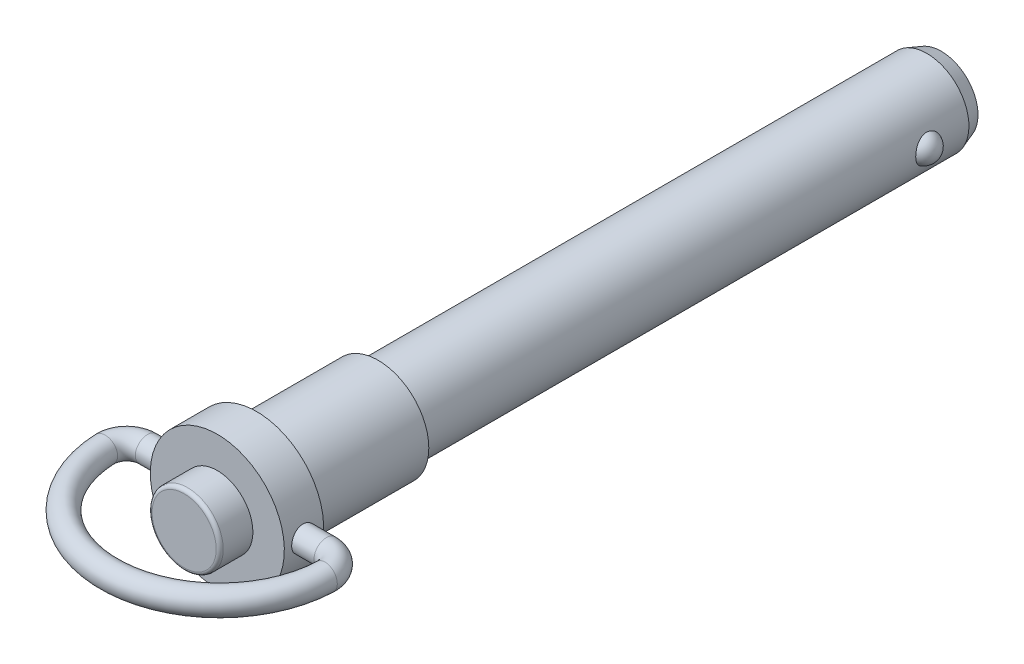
ISO-10303-21;
HEADER;
FILE_DESCRIPTION(('STEP AP214'),'2;1');
FILE_NAME('part.step','',(''),(''),'','','');
FILE_SCHEMA(('AUTOMOTIVE_DESIGN { 1 0 10303 214 1 1 1 1 }'));
ENDSEC;
DATA;
#1=APPLICATION_CONTEXT('core data for automotive mechanical design processes');
#2=APPLICATION_PROTOCOL_DEFINITION('international standard','automotive_design',2000,#1);
#3=PRODUCT_CONTEXT('',#1,'mechanical');
#4=PRODUCT('Part','Part','',(#3));
#5=PRODUCT_RELATED_PRODUCT_CATEGORY('part','',(#4));
#6=PRODUCT_DEFINITION_FORMATION('','',#4);
#7=PRODUCT_DEFINITION_CONTEXT('part definition',#1,'design');
#8=PRODUCT_DEFINITION('design','',#6,#7);
#9=PRODUCT_DEFINITION_SHAPE('','',#8);
#10=(LENGTH_UNIT() NAMED_UNIT(*) SI_UNIT(.MILLI.,.METRE.));
#11=(NAMED_UNIT(*) PLANE_ANGLE_UNIT() SI_UNIT($,.RADIAN.));
#12=(NAMED_UNIT(*) SI_UNIT($,.STERADIAN.) SOLID_ANGLE_UNIT());
#13=UNCERTAINTY_MEASURE_WITH_UNIT(LENGTH_MEASURE(1.E-05),#10,'distance_accuracy_value','');
#14=(GEOMETRIC_REPRESENTATION_CONTEXT(3) GLOBAL_UNCERTAINTY_ASSIGNED_CONTEXT((#13)) GLOBAL_UNIT_ASSIGNED_CONTEXT((#10,
#11,#12)) REPRESENTATION_CONTEXT('',''));
#15=CARTESIAN_POINT('',(0.,0.,0.));
#16=DIRECTION('',(0.,0.,1.));
#17=DIRECTION('',(1.,0.,0.));
#18=AXIS2_PLACEMENT_3D('',#15,#16,#17);
#19=CARTESIAN_POINT('',(0.,0.,27.575));
#20=DIRECTION('',(0.,0.,1.));
#21=DIRECTION('',(1.,0.,0.));
#22=AXIS2_PLACEMENT_3D('',#19,#20,#21);
#23=PLANE('',#22);
#24=CARTESIAN_POINT('',(0.,0.,27.575));
#25=DIRECTION('',(0.,0.,1.));
#26=DIRECTION('',(1.,0.,0.));
#27=AXIS2_PLACEMENT_3D('',#24,#25,#26);
#28=CIRCLE('',#27,4.5546);
#29=CARTESIAN_POINT('',(4.5546,0.,27.575));
#30=VERTEX_POINT('',#29);
#31=EDGE_CURVE('E144',#30,#30,#28,.T.);
#32=ORIENTED_EDGE('',*,*,#31,.T.);
#33=EDGE_LOOP('',(#32));
#34=FACE_BOUND('',#33,.T.);
#35=ADVANCED_FACE('F12',(#34),#23,.T.);
#36=CARTESIAN_POINT('',(0.,0.,22.5357550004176));
#37=DIRECTION('',(0.,1.,0.));
#38=DIRECTION('',(0.,0.,1.));
#39=AXIS2_PLACEMENT_3D('',#36,#37,#38);
#40=TOROIDAL_SURFACE('',#39,15.6980038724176,1.75);
#41=CARTESIAN_POINT('',(-15.6851704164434,0.,23.1703844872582));
#42=DIRECTION('',(-0.0404274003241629,0.,-0.999182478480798));
#43=DIRECTION('',(-0.999182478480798,0.,0.0404274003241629));
#44=AXIS2_PLACEMENT_3D('',#41,#42,#43);
#45=CIRCLE('',#44,1.75);
#46=CARTESIAN_POINT('',(-17.4337397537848,0.,23.2411324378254));
#47=VERTEX_POINT('',#46);
#48=EDGE_CURVE('E145',#47,#47,#45,.T.);
#49=CARTESIAN_POINT('',(15.6851704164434,0.,23.1703844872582));
#50=DIRECTION('',(-0.0404274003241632,0.,0.999182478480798));
#51=DIRECTION('',(0.999182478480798,0.,0.0404274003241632));
#52=AXIS2_PLACEMENT_3D('',#49,#50,#51);
#53=CIRCLE('',#52,1.75);
#54=CARTESIAN_POINT('',(17.4337397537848,0.,23.2411324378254));
#55=VERTEX_POINT('',#54);
#56=EDGE_CURVE('E137',#55,#55,#53,.T.);
#57=CARTESIAN_POINT('',(0.,0.,22.5357550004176));
#58=DIRECTION('',(0.,1.,0.));
#59=DIRECTION('',(0.,0.,1.));
#60=AXIS2_PLACEMENT_3D('',#57,#58,#59);
#61=CIRCLE('',#60,17.4480038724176);
#62=EDGE_CURVE('',#47,#55,#61,.T.);
#63=ORIENTED_EDGE('',*,*,#48,.F.);
#64=ORIENTED_EDGE('',*,*,#56,.T.);
#65=ORIENTED_EDGE('',*,*,#62,.T.);
#66=ORIENTED_EDGE('',*,*,#62,.F.);
#67=EDGE_LOOP('',(#63,#65,#64,#66));
#68=FACE_BOUND('',#67,.T.);
#69=ADVANCED_FACE('F74',(#68),#40,.T.);
#70=CARTESIAN_POINT('',(0.,0.,27.075));
#71=DIRECTION('',(0.,0.,1.));
#72=DIRECTION('',(1.,0.,0.));
#73=AXIS2_PLACEMENT_3D('',#70,#71,#72);
#74=TOROIDAL_SURFACE('',#73,4.5546,0.5);
#75=CARTESIAN_POINT('',(0.,0.,27.075));
#76=DIRECTION('',(0.,0.,1.));
#77=DIRECTION('',(1.,0.,0.));
#78=AXIS2_PLACEMENT_3D('',#75,#76,#77);
#79=CIRCLE('',#78,5.0546);
#80=CARTESIAN_POINT('',(5.0546,0.,27.075));
#81=VERTEX_POINT('',#80);
#82=EDGE_CURVE('E150',#81,#81,#79,.T.);
#83=ORIENTED_EDGE('',*,*,#82,.T.);
#84=EDGE_LOOP('',(#83));
#85=FACE_BOUND('',#84,.T.);
#86=ORIENTED_EDGE('',*,*,#31,.F.);
#87=EDGE_LOOP('',(#86));
#88=FACE_BOUND('',#87,.T.);
#89=ADVANCED_FACE('F80',(#85,#88),#74,.T.);
#90=CARTESIAN_POINT('',(12.7038508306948,0.,23.0497588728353));
#91=DIRECTION('',(0.,1.,0.));
#92=DIRECTION('',(0.,0.,1.));
#93=AXIS2_PLACEMENT_3D('',#90,#91,#92);
#94=TOROIDAL_SURFACE('',#93,2.98375887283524,1.75);
#95=CARTESIAN_POINT('',(12.7038508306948,0.,20.066));
#96=DIRECTION('',(1.,0.,0.));
#97=DIRECTION('',(0.,0.,-1.));
#98=AXIS2_PLACEMENT_3D('',#95,#96,#97);
#99=CIRCLE('',#98,1.75);
#100=CARTESIAN_POINT('',(12.7038508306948,0.,18.316));
#101=VERTEX_POINT('',#100);
#102=EDGE_CURVE('E140',#101,#101,#99,.T.);
#103=CARTESIAN_POINT('',(12.7038508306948,0.,23.0497588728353));
#104=DIRECTION('',(0.,1.,0.));
#105=DIRECTION('',(0.,0.,1.));
#106=AXIS2_PLACEMENT_3D('',#103,#104,#105);
#107=CIRCLE('',#106,4.73375887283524);
#108=EDGE_CURVE('',#55,#101,#107,.T.);
#109=ORIENTED_EDGE('',*,*,#56,.F.);
#110=ORIENTED_EDGE('',*,*,#102,.T.);
#111=ORIENTED_EDGE('',*,*,#108,.T.);
#112=ORIENTED_EDGE('',*,*,#108,.F.);
#113=EDGE_LOOP('',(#109,#111,#110,#112));
#114=FACE_BOUND('',#113,.T.);
#115=ADVANCED_FACE('F90',(#114),#94,.T.);
#116=CARTESIAN_POINT('',(-12.7038508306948,0.,23.0497588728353));
#117=DIRECTION('',(0.,1.,0.));
#118=DIRECTION('',(0.,0.,1.));
#119=AXIS2_PLACEMENT_3D('',#116,#117,#118);
#120=TOROIDAL_SURFACE('',#119,2.98375887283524,1.75);
#121=CARTESIAN_POINT('',(-12.7038508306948,0.,20.066));
#122=DIRECTION('',(1.,0.,0.));
#123=DIRECTION('',(0.,0.,-1.));
#124=AXIS2_PLACEMENT_3D('',#121,#122,#123);
#125=CIRCLE('',#124,1.75);
#126=CARTESIAN_POINT('',(-12.7038508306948,0.,18.316));
#127=VERTEX_POINT('',#126);
#128=EDGE_CURVE('E307',#127,#127,#125,.T.);
#129=CARTESIAN_POINT('',(-12.7038508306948,0.,23.0497588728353));
#130=DIRECTION('',(0.,1.,0.));
#131=DIRECTION('',(0.,0.,1.));
#132=AXIS2_PLACEMENT_3D('',#129,#130,#131);
#133=CIRCLE('',#132,4.73375887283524);
#134=EDGE_CURVE('',#127,#47,#133,.T.);
#135=ORIENTED_EDGE('',*,*,#128,.F.);
#136=ORIENTED_EDGE('',*,*,#48,.T.);
#137=ORIENTED_EDGE('',*,*,#134,.T.);
#138=ORIENTED_EDGE('',*,*,#134,.F.);
#139=EDGE_LOOP('',(#135,#137,#136,#138));
#140=FACE_BOUND('',#139,.T.);
#141=ADVANCED_FACE('F105',(#140),#120,.T.);
#142=CARTESIAN_POINT('',(0.,0.,28.575));
#143=DIRECTION('',(0.,0.,-1.));
#144=DIRECTION('',(0.,-1.,0.));
#145=AXIS2_PLACEMENT_3D('',#142,#143,#144);
#146=CYLINDRICAL_SURFACE('',#145,5.0546);
#147=ORIENTED_EDGE('',*,*,#82,.F.);
#148=EDGE_LOOP('',(#147));
#149=FACE_BOUND('',#148,.T.);
#150=CARTESIAN_POINT('',(0.,0.,22.86));
#151=DIRECTION('',(0.,0.,-1.));
#152=DIRECTION('',(0.,-1.,0.));
#153=AXIS2_PLACEMENT_3D('',#150,#151,#152);
#154=CIRCLE('',#153,5.0546);
#155=CARTESIAN_POINT('',(0.,-5.0546,22.86));
#156=VERTEX_POINT('',#155);
#157=EDGE_CURVE('E122',#156,#156,#154,.T.);
#158=ORIENTED_EDGE('',*,*,#157,.F.);
#159=EDGE_LOOP('',(#158));
#160=FACE_BOUND('',#159,.T.);
#161=ADVANCED_FACE('F102',(#149,#160),#146,.T.);
#162=CARTESIAN_POINT('',(12.7038508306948,0.,20.066));
#163=DIRECTION('',(-1.,0.,0.));
#164=DIRECTION('',(0.,0.,1.));
#165=AXIS2_PLACEMENT_3D('',#162,#163,#164);
#166=CYLINDRICAL_SURFACE('',#165,1.75);
#167=CARTESIAN_POINT('',(9.525,0.,21.816));
#168=CARTESIAN_POINT('',(9.52499824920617,0.0974196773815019,21.8159962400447));
#169=CARTESIAN_POINT('',(9.52348996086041,0.194888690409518,21.8078377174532));
#170=CARTESIAN_POINT('',(9.51761845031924,0.387082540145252,21.7754387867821));
#171=CARTESIAN_POINT('',(9.5132527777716,0.481804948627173,21.7511845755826));
#172=CARTESIAN_POINT('',(9.50215510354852,0.66569803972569,21.6873599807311));
#173=CARTESIAN_POINT('',(9.49542520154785,0.75487356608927,21.6478031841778));
#174=CARTESIAN_POINT('',(9.48033492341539,0.925313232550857,21.5545343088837));
#175=CARTESIAN_POINT('',(9.4719746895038,1.00657806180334,21.5008234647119));
#176=CARTESIAN_POINT('',(9.45443959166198,1.15983447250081,21.38011409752));
#177=CARTESIAN_POINT('',(9.44525721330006,1.23172173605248,21.3129842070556));
#178=CARTESIAN_POINT('',(9.42716883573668,1.36328019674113,21.1676249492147));
#179=CARTESIAN_POINT('',(9.41826285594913,1.42295053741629,21.0893948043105));
#180=CARTESIAN_POINT('',(9.40166266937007,1.52881224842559,20.9233223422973));
#181=CARTESIAN_POINT('',(9.39397815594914,1.57489805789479,20.8354116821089));
#182=CARTESIAN_POINT('',(9.3807965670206,1.65160688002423,20.6529311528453));
#183=CARTESIAN_POINT('',(9.3752993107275,1.68223117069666,20.5583618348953));
#184=CARTESIAN_POINT('',(9.36719014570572,1.72681399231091,20.3663627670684));
#185=CARTESIAN_POINT('',(9.36454682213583,1.74095411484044,20.2689765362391));
#186=CARTESIAN_POINT('',(9.36235004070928,1.75273074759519,20.0731807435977));
#187=CARTESIAN_POINT('',(9.3627963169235,1.75036867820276,19.9747712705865));
#188=CARTESIAN_POINT('',(9.36669969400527,1.72935535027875,19.7810343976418));
#189=CARTESIAN_POINT('',(9.37011871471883,1.71091010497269,19.6856837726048));
#190=CARTESIAN_POINT('',(9.37952256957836,1.65857824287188,19.49945389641));
#191=CARTESIAN_POINT('',(9.38550750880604,1.62469099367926,19.4085748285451));
#192=CARTESIAN_POINT('',(9.39940890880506,1.54223419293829,19.2332623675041));
#193=CARTESIAN_POINT('',(9.40733632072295,1.49358101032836,19.1488692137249));
#194=CARTESIAN_POINT('',(9.42422213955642,1.38303261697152,18.98936699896));
#195=CARTESIAN_POINT('',(9.43318064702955,1.32113611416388,18.9142588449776));
#196=CARTESIAN_POINT('',(9.45128545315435,1.184745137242,18.77426795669));
#197=CARTESIAN_POINT('',(9.46043254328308,1.11007434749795,18.7095569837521));
#198=CARTESIAN_POINT('',(9.47775926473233,0.950845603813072,18.5935547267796));
#199=CARTESIAN_POINT('',(9.48593888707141,0.866287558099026,18.5422635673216));
#200=CARTESIAN_POINT('',(9.50042458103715,0.689508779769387,18.4545334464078));
#201=CARTESIAN_POINT('',(9.50672846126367,0.597279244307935,18.4181118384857));
#202=CARTESIAN_POINT('',(9.51673535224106,0.407869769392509,18.3613256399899));
#203=CARTESIAN_POINT('',(9.52043862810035,0.310690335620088,18.3409594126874));
#204=CARTESIAN_POINT('',(9.5247907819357,0.115617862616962,18.3170999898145));
#205=CARTESIAN_POINT('',(9.52548227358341,0.0177545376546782,18.313371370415));
#206=CARTESIAN_POINT('',(9.52385046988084,-0.17719740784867,18.3222622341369));
#207=CARTESIAN_POINT('',(9.52152731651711,-0.274286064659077,18.3348809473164));
#208=CARTESIAN_POINT('',(9.51415375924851,-0.46418965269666,18.3759125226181));
#209=CARTESIAN_POINT('',(9.50912384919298,-0.557031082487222,18.4042067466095));
#210=CARTESIAN_POINT('',(9.49689842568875,-0.736652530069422,18.4756581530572));
#211=CARTESIAN_POINT('',(9.48970276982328,-0.823432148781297,18.5188163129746));
#212=CARTESIAN_POINT('',(9.47383776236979,-0.98947475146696,18.6192949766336));
#213=CARTESIAN_POINT('',(9.46515367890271,-1.06864888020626,18.676759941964));
#214=CARTESIAN_POINT('',(9.44731421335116,-1.21631462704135,18.8040249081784));
#215=CARTESIAN_POINT('',(9.43815878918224,-1.28480528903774,18.873826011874));
#216=CARTESIAN_POINT('',(9.42026781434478,-1.41005035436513,19.0248458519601));
#217=CARTESIAN_POINT('',(9.41153908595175,-1.46664438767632,19.1061985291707));
#218=CARTESIAN_POINT('',(9.39562517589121,-1.56536359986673,19.277394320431));
#219=CARTESIAN_POINT('',(9.38843993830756,-1.60748930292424,19.3672371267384));
#220=CARTESIAN_POINT('',(9.3764796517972,-1.67584630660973,19.5524479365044));
#221=CARTESIAN_POINT('',(9.37169329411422,-1.70215230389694,19.6477876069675));
#222=CARTESIAN_POINT('',(9.36504636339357,-1.73835449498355,19.8416293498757));
#223=CARTESIAN_POINT('',(9.36318547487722,-1.7482524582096,19.9401310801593));
#224=CARTESIAN_POINT('',(9.3626157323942,-1.75130025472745,20.1358954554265));
#225=CARTESIAN_POINT('',(9.36385929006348,-1.74470294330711,20.2331541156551));
#226=CARTESIAN_POINT('',(9.36925303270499,-1.71549975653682,20.4251511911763));
#227=CARTESIAN_POINT('',(9.37340320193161,-1.69289396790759,20.5198896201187));
#228=CARTESIAN_POINT('',(9.38412287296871,-1.63242039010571,20.7040281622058));
#229=CARTESIAN_POINT('',(9.39068820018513,-1.5945789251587,20.7934371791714));
#230=CARTESIAN_POINT('',(9.40550157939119,-1.50473547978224,20.964677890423));
#231=CARTESIAN_POINT('',(9.41374974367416,-1.45273255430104,21.0465090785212));
#232=CARTESIAN_POINT('',(9.43114776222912,-1.33515884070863,21.2015399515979));
#233=CARTESIAN_POINT('',(9.44030888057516,-1.26940363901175,21.2745985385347));
#234=CARTESIAN_POINT('',(9.45841527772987,-1.12657740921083,21.4087295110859));
#235=CARTESIAN_POINT('',(9.4673605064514,-1.04950378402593,21.4697991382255));
#236=CARTESIAN_POINT('',(9.4841172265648,-0.885436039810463,21.5787070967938));
#237=CARTESIAN_POINT('',(9.49191831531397,-0.798362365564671,21.6264272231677));
#238=CARTESIAN_POINT('',(9.50540634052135,-0.617319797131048,21.7064857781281));
#239=CARTESIAN_POINT('',(9.51109528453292,-0.523357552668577,21.7388388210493));
#240=CARTESIAN_POINT('',(9.51854259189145,-0.357584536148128,21.7805891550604));
#241=CARTESIAN_POINT('',(9.52095058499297,-0.286749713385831,21.7938458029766));
#242=CARTESIAN_POINT('',(9.52417991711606,-0.143952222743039,21.8115525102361));
#243=CARTESIAN_POINT('',(9.52500129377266,-0.0719895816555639,21.8160027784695));
#244=CARTESIAN_POINT('',(9.525,0.,21.816));
#245=B_SPLINE_CURVE_WITH_KNOTS('',3,(#167,#168,#169,#170,#171,#172,#173,#174,#175,#176,#177,
#178,#179,#180,#181,#182,#183,#184,#185,#186,#187,#188,#189,#190,#191,#192,#193,#194,#195,#196,
#197,#198,#199,#200,#201,#202,#203,#204,#205,#206,#207,#208,#209,#210,#211,#212,#213,#214,#215,
#216,#217,#218,#219,#220,#221,#222,#223,#224,#225,#226,#227,#228,#229,#230,#231,#232,#233,#234,
#235,#236,#237,#238,#239,#240,#241,#242,#243,#244),.UNSPECIFIED.,.T.,.F.,(4,2,2,2,2,2,2,2,2,2,2,
2,2,2,2,2,2,2,2,2,2,2,2,2,2,2,2,2,2,2,2,2,2,2,2,2,2,2,4),(0.,0.291995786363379,
0.584242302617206,0.876229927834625,1.16819209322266,1.46316632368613,1.75816122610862,
2.05539140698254,2.35259701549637,2.64649667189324,2.94037103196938,3.23053548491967,
3.52071182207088,3.81256333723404,4.10444333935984,4.40073615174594,4.69703171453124,
4.9936720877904,5.29028221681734,5.58268169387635,5.87506739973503,6.1652698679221,
6.45549142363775,6.74877158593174,7.04207797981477,7.3391152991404,7.63614185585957,
7.93175468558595,8.22733563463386,8.51841349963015,8.80948978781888,9.10006529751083,
9.39066020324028,9.68543533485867,9.98027821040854,10.2776546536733,10.574747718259,
10.7905270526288,11.0063012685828),.UNSPECIFIED.);
#246=CARTESIAN_POINT('',(9.525,0.,21.816));
#247=VERTEX_POINT('',#246);
#248=EDGE_CURVE('E29',#247,#247,#245,.T.);
#249=ORIENTED_EDGE('',*,*,#248,.F.);
#250=EDGE_LOOP('',(#249));
#251=FACE_BOUND('',#250,.T.);
#252=ORIENTED_EDGE('',*,*,#102,.F.);
#253=EDGE_LOOP('',(#252));
#254=FACE_BOUND('',#253,.T.);
#255=ADVANCED_FACE('F85',(#251,#254),#166,.T.);
#256=CARTESIAN_POINT('',(-12.7038508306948,0.,20.066));
#257=DIRECTION('',(1.,0.,0.));
#258=DIRECTION('',(0.,0.,-1.));
#259=AXIS2_PLACEMENT_3D('',#256,#257,#258);
#260=CYLINDRICAL_SURFACE('',#259,1.75);
#261=CARTESIAN_POINT('',(-9.525,0.,18.316));
#262=CARTESIAN_POINT('',(-9.52499824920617,-0.097419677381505,18.3160037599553));
#263=CARTESIAN_POINT('',(-9.52348996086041,-0.194888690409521,18.3241622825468));
#264=CARTESIAN_POINT('',(-9.51761845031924,-0.387082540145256,18.3565612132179));
#265=CARTESIAN_POINT('',(-9.5132527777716,-0.481804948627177,18.3808154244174));
#266=CARTESIAN_POINT('',(-9.50215510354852,-0.665698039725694,18.4446400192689));
#267=CARTESIAN_POINT('',(-9.49542520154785,-0.754873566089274,18.4841968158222));
#268=CARTESIAN_POINT('',(-9.48033492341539,-0.925313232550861,18.5774656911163));
#269=CARTESIAN_POINT('',(-9.4719746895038,-1.00657806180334,18.6311765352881));
#270=CARTESIAN_POINT('',(-9.45443959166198,-1.15983447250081,18.75188590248));
#271=CARTESIAN_POINT('',(-9.44525721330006,-1.23172173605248,18.8190157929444));
#272=CARTESIAN_POINT('',(-9.42716883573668,-1.36328019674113,18.9643750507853));
#273=CARTESIAN_POINT('',(-9.41826285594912,-1.4229505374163,19.0426051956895));
#274=CARTESIAN_POINT('',(-9.40166266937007,-1.52881224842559,19.2086776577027));
#275=CARTESIAN_POINT('',(-9.39397815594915,-1.57489805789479,19.2965883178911));
#276=CARTESIAN_POINT('',(-9.3807965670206,-1.65160688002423,19.4790688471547));
#277=CARTESIAN_POINT('',(-9.3752993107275,-1.68223117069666,19.5736381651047));
#278=CARTESIAN_POINT('',(-9.36719014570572,-1.72681399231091,19.7656372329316));
#279=CARTESIAN_POINT('',(-9.36454682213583,-1.74095411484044,19.8630234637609));
#280=CARTESIAN_POINT('',(-9.36235004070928,-1.7527307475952,20.0588192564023));
#281=CARTESIAN_POINT('',(-9.3627963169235,-1.75036867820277,20.1572287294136));
#282=CARTESIAN_POINT('',(-9.36669969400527,-1.72935535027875,20.3509656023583));
#283=CARTESIAN_POINT('',(-9.37011871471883,-1.71091010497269,20.4463162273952));
#284=CARTESIAN_POINT('',(-9.37952256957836,-1.65857824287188,20.63254610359));
#285=CARTESIAN_POINT('',(-9.38550750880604,-1.62469099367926,20.7234251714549));
#286=CARTESIAN_POINT('',(-9.39940890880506,-1.54223419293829,20.8987376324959));
#287=CARTESIAN_POINT('',(-9.40733632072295,-1.49358101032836,20.9831307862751));
#288=CARTESIAN_POINT('',(-9.42422213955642,-1.38303261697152,21.14263300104));
#289=CARTESIAN_POINT('',(-9.43318064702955,-1.32113611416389,21.2177411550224));
#290=CARTESIAN_POINT('',(-9.45128545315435,-1.184745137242,21.35773204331));
#291=CARTESIAN_POINT('',(-9.46043254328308,-1.11007434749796,21.4224430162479));
#292=CARTESIAN_POINT('',(-9.47775926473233,-0.950845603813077,21.5384452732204));
#293=CARTESIAN_POINT('',(-9.48593888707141,-0.86628755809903,21.5897364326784));
#294=CARTESIAN_POINT('',(-9.50042458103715,-0.689508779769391,21.6774665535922));
#295=CARTESIAN_POINT('',(-9.50672846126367,-0.597279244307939,21.7138881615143));
#296=CARTESIAN_POINT('',(-9.51673535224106,-0.407869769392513,21.7706743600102));
#297=CARTESIAN_POINT('',(-9.52043862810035,-0.310690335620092,21.7910405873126));
#298=CARTESIAN_POINT('',(-9.5247907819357,-0.115617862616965,21.8149000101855));
#299=CARTESIAN_POINT('',(-9.52548227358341,-0.0177545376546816,21.818628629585));
#300=CARTESIAN_POINT('',(-9.52385046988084,0.177197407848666,21.8097377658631));
#301=CARTESIAN_POINT('',(-9.52152731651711,0.274286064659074,21.7971190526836));
#302=CARTESIAN_POINT('',(-9.51415375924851,0.464189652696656,21.7560874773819));
#303=CARTESIAN_POINT('',(-9.50912384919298,0.557031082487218,21.7277932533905));
#304=CARTESIAN_POINT('',(-9.49689842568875,0.736652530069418,21.6563418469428));
#305=CARTESIAN_POINT('',(-9.48970276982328,0.823432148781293,21.6131836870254));
#306=CARTESIAN_POINT('',(-9.47383776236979,0.989474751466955,21.5127050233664));
#307=CARTESIAN_POINT('',(-9.46515367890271,1.06864888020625,21.455240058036));
#308=CARTESIAN_POINT('',(-9.44731421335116,1.21631462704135,21.3279750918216));
#309=CARTESIAN_POINT('',(-9.43815878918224,1.28480528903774,21.258173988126));
#310=CARTESIAN_POINT('',(-9.42026781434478,1.41005035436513,21.1071541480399));
#311=CARTESIAN_POINT('',(-9.41153908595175,1.46664438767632,21.0258014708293));
#312=CARTESIAN_POINT('',(-9.39562517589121,1.56536359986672,20.854605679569));
#313=CARTESIAN_POINT('',(-9.38843993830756,1.60748930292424,20.7647628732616));
#314=CARTESIAN_POINT('',(-9.3764796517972,1.67584630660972,20.5795520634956));
#315=CARTESIAN_POINT('',(-9.37169329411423,1.70215230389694,20.4842123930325));
#316=CARTESIAN_POINT('',(-9.36504636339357,1.73835449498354,20.2903706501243));
#317=CARTESIAN_POINT('',(-9.36318547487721,1.74825245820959,20.1918689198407));
#318=CARTESIAN_POINT('',(-9.3626157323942,1.75130025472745,19.9961045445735));
#319=CARTESIAN_POINT('',(-9.36385929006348,1.74470294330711,19.8988458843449));
#320=CARTESIAN_POINT('',(-9.36925303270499,1.71549975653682,19.7068488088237));
#321=CARTESIAN_POINT('',(-9.3734032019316,1.69289396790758,19.6121103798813));
#322=CARTESIAN_POINT('',(-9.3841228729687,1.6324203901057,19.4279718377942));
#323=CARTESIAN_POINT('',(-9.39068820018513,1.5945789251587,19.3385628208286));
#324=CARTESIAN_POINT('',(-9.40550157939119,1.50473547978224,19.167322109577));
#325=CARTESIAN_POINT('',(-9.41374974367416,1.45273255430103,19.0854909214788));
#326=CARTESIAN_POINT('',(-9.43114776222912,1.33515884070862,18.9304600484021));
#327=CARTESIAN_POINT('',(-9.44030888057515,1.26940363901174,18.8574014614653));
#328=CARTESIAN_POINT('',(-9.45841527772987,1.12657740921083,18.7232704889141));
#329=CARTESIAN_POINT('',(-9.4673605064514,1.04950378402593,18.6622008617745));
#330=CARTESIAN_POINT('',(-9.4841172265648,0.885436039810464,18.5532929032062));
#331=CARTESIAN_POINT('',(-9.49191831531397,0.798362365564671,18.5055727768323));
#332=CARTESIAN_POINT('',(-9.50540634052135,0.617319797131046,18.4255142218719));
#333=CARTESIAN_POINT('',(-9.51109528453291,0.523357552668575,18.3931611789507));
#334=CARTESIAN_POINT('',(-9.51854259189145,0.357584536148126,18.3514108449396));
#335=CARTESIAN_POINT('',(-9.52095058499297,0.286749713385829,18.3381541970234));
#336=CARTESIAN_POINT('',(-9.52417991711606,0.143952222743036,18.3204474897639));
#337=CARTESIAN_POINT('',(-9.52500129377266,0.0719895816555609,18.3159972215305));
#338=CARTESIAN_POINT('',(-9.525,0.,18.316));
#339=B_SPLINE_CURVE_WITH_KNOTS('',3,(#261,#262,#263,#264,#265,#266,#267,#268,#269,#270,#271,
#272,#273,#274,#275,#276,#277,#278,#279,#280,#281,#282,#283,#284,#285,#286,#287,#288,#289,#290,
#291,#292,#293,#294,#295,#296,#297,#298,#299,#300,#301,#302,#303,#304,#305,#306,#307,#308,#309,
#310,#311,#312,#313,#314,#315,#316,#317,#318,#319,#320,#321,#322,#323,#324,#325,#326,#327,#328,
#329,#330,#331,#332,#333,#334,#335,#336,#337,#338),.UNSPECIFIED.,.T.,.F.,(4,2,2,2,2,2,2,2,2,2,2,
2,2,2,2,2,2,2,2,2,2,2,2,2,2,2,2,2,2,2,2,2,2,2,2,2,2,2,4),(0.,0.291995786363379,
0.584242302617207,0.876229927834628,1.16819209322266,1.46316632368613,1.75816122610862,
2.05539140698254,2.35259701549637,2.64649667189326,2.94037103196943,3.23053548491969,
3.52071182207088,3.81256333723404,4.10444333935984,4.40073615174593,4.69703171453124,
4.9936720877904,5.29028221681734,5.58268169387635,5.87506739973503,6.1652698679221,
6.45549142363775,6.74877158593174,7.04207797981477,7.3391152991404,7.63614185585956,
7.93175468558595,8.22733563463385,8.51841349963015,8.80948978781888,9.10006529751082,
9.39066020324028,9.68543533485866,9.98027821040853,10.2776546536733,10.574747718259,
10.7905270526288,11.0063012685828),.UNSPECIFIED.);
#340=CARTESIAN_POINT('',(-9.525,0.,18.316));
#341=VERTEX_POINT('',#340);
#342=EDGE_CURVE('E20',#341,#341,#339,.T.);
#343=ORIENTED_EDGE('',*,*,#342,.T.);
#344=EDGE_LOOP('',(#343));
#345=FACE_BOUND('',#344,.T.);
#346=ORIENTED_EDGE('',*,*,#128,.T.);
#347=EDGE_LOOP('',(#346));
#348=FACE_BOUND('',#347,.T.);
#349=ADVANCED_FACE('F110',(#345,#348),#260,.T.);
#350=CARTESIAN_POINT('',(-9.525,0.,22.86));
#351=DIRECTION('',(0.,0.,1.));
#352=DIRECTION('',(0.,1.,0.));
#353=AXIS2_PLACEMENT_3D('',#350,#351,#352);
#354=PLANE('',#353);
#355=ORIENTED_EDGE('',*,*,#157,.T.);
#356=EDGE_LOOP('',(#355));
#357=FACE_BOUND('',#356,.T.);
#358=CARTESIAN_POINT('',(0.,0.,22.86));
#359=DIRECTION('',(0.,0.,-1.));
#360=DIRECTION('',(0.,-1.,0.));
#361=AXIS2_PLACEMENT_3D('',#358,#359,#360);
#362=CIRCLE('',#361,9.525);
#363=CARTESIAN_POINT('',(0.,-9.525,22.86));
#364=VERTEX_POINT('',#363);
#365=EDGE_CURVE('E163',#364,#364,#362,.T.);
#366=ORIENTED_EDGE('',*,*,#365,.F.);
#367=EDGE_LOOP('',(#366));
#368=FACE_BOUND('',#367,.T.);
#369=ADVANCED_FACE('F107',(#357,#368),#354,.T.);
#370=CARTESIAN_POINT('',(0.,0.,0.));
#371=DIRECTION('',(0.,0.,-1.));
#372=DIRECTION('',(0.,-1.,0.));
#373=AXIS2_PLACEMENT_3D('',#370,#371,#372);
#374=CYLINDRICAL_SURFACE('',#373,9.525);
#375=CARTESIAN_POINT('',(0.,0.,17.272));
#376=DIRECTION('',(0.,0.,-1.));
#377=DIRECTION('',(0.,-1.,0.));
#378=AXIS2_PLACEMENT_3D('',#375,#376,#377);
#379=CIRCLE('',#378,9.525);
#380=CARTESIAN_POINT('',(0.,-9.525,17.272));
#381=VERTEX_POINT('',#380);
#382=EDGE_CURVE('E25',#381,#381,#379,.T.);
#383=ORIENTED_EDGE('',*,*,#382,.F.);
#384=EDGE_LOOP('',(#383));
#385=FACE_BOUND('',#384,.T.);
#386=ORIENTED_EDGE('',*,*,#365,.T.);
#387=EDGE_LOOP('',(#386));
#388=FACE_BOUND('',#387,.T.);
#389=ORIENTED_EDGE('',*,*,#342,.F.);
#390=EDGE_LOOP('',(#389));
#391=FACE_BOUND('',#390,.T.);
#392=ORIENTED_EDGE('',*,*,#248,.T.);
#393=EDGE_LOOP('',(#392));
#394=FACE_BOUND('',#393,.T.);
#395=ADVANCED_FACE('F109',(#385,#388,#391,#394),#374,.T.);
#396=CARTESIAN_POINT('',(-8.9535,0.,17.272));
#397=DIRECTION('',(0.,0.,-1.));
#398=DIRECTION('',(0.,-1.,0.));
#399=AXIS2_PLACEMENT_3D('',#396,#397,#398);
#400=PLANE('',#399);
#401=ORIENTED_EDGE('',*,*,#382,.T.);
#402=EDGE_LOOP('',(#401));
#403=FACE_BOUND('',#402,.T.);
#404=CARTESIAN_POINT('',(0.,0.,17.272));
#405=DIRECTION('',(0.,0.,1.));
#406=DIRECTION('',(1.,0.,0.));
#407=AXIS2_PLACEMENT_3D('',#404,#405,#406);
#408=CIRCLE('',#407,7.6);
#409=CARTESIAN_POINT('',(7.6,0.,17.272));
#410=VERTEX_POINT('',#409);
#411=EDGE_CURVE('E153',#410,#410,#408,.T.);
#412=ORIENTED_EDGE('',*,*,#411,.T.);
#413=EDGE_LOOP('',(#412));
#414=FACE_BOUND('',#413,.T.);
#415=ADVANCED_FACE('F96',(#403,#414),#400,.T.);
#416=CARTESIAN_POINT('',(0.,0.,16.872));
#417=DIRECTION('',(0.,0.,1.));
#418=DIRECTION('',(1.,0.,0.));
#419=AXIS2_PLACEMENT_3D('',#416,#417,#418);
#420=TOROIDAL_SURFACE('',#419,7.6,0.4);
#421=CARTESIAN_POINT('',(0.,0.,16.872));
#422=DIRECTION('',(0.,0.,1.));
#423=DIRECTION('',(1.,0.,0.));
#424=AXIS2_PLACEMENT_3D('',#421,#422,#423);
#425=CIRCLE('',#424,7.2);
#426=CARTESIAN_POINT('',(7.2,0.,16.872));
#427=VERTEX_POINT('',#426);
#428=EDGE_CURVE('E156',#427,#427,#425,.T.);
#429=ORIENTED_EDGE('',*,*,#428,.T.);
#430=EDGE_LOOP('',(#429));
#431=FACE_BOUND('',#430,.T.);
#432=ORIENTED_EDGE('',*,*,#411,.F.);
#433=EDGE_LOOP('',(#432));
#434=FACE_BOUND('',#433,.T.);
#435=ADVANCED_FACE('F92',(#431,#434),#420,.F.);
#436=CARTESIAN_POINT('',(0.,0.,30.025216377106));
#437=DIRECTION('',(0.,0.,1.));
#438=DIRECTION('',(1.,0.,0.));
#439=AXIS2_PLACEMENT_3D('',#436,#437,#438);
#440=CYLINDRICAL_SURFACE('',#439,7.2);
#441=CARTESIAN_POINT('',(0.,0.,0.));
#442=DIRECTION('',(0.,0.,1.));
#443=DIRECTION('',(1.,0.,0.));
#444=AXIS2_PLACEMENT_3D('',#441,#442,#443);
#445=CIRCLE('',#444,7.2);
#446=CARTESIAN_POINT('',(7.2,0.,0.));
#447=VERTEX_POINT('',#446);
#448=EDGE_CURVE('E159',#447,#447,#445,.T.);
#449=ORIENTED_EDGE('',*,*,#448,.T.);
#450=EDGE_LOOP('',(#449));
#451=FACE_BOUND('',#450,.T.);
#452=ORIENTED_EDGE('',*,*,#428,.F.);
#453=EDGE_LOOP('',(#452));
#454=FACE_BOUND('',#453,.T.);
#455=ADVANCED_FACE('F95',(#451,#454),#440,.T.);
#456=CARTESIAN_POINT('',(0.,0.,0.));
#457=DIRECTION('',(0.,0.,-1.));
#458=DIRECTION('',(0.,-1.,0.));
#459=AXIS2_PLACEMENT_3D('',#456,#457,#458);
#460=PLANE('',#459);
#461=ORIENTED_EDGE('',*,*,#448,.F.);
#462=EDGE_LOOP('',(#461));
#463=FACE_BOUND('',#462,.T.);
#464=CARTESIAN_POINT('',(0.,0.,0.));
#465=DIRECTION('',(0.,0.,-1.));
#466=DIRECTION('',(0.,1.,0.));
#467=AXIS2_PLACEMENT_3D('',#464,#465,#466);
#468=CIRCLE('',#467,5.969635);
#469=CARTESIAN_POINT('',(0.,5.969635,0.));
#470=VERTEX_POINT('',#469);
#471=EDGE_CURVE('E8',#470,#470,#468,.F.);
#472=ORIENTED_EDGE('',*,*,#471,.T.);
#473=EDGE_LOOP('',(#472));
#474=FACE_BOUND('',#473,.T.);
#475=ADVANCED_FACE('F100',(#463,#474),#460,.T.);
#476=CARTESIAN_POINT('',(-5.23004748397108,0.,-80.0304));
#477=DIRECTION('',(0.,0.,1.));
#478=DIRECTION('',(0.,1.,0.));
#479=AXIS2_PLACEMENT_3D('',#476,#477,#478);
#480=PLANE('',#479);
#481=CARTESIAN_POINT('',(0.,0.,-80.0303999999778));
#482=DIRECTION('',(0.,0.,1.));
#483=DIRECTION('',(0.,1.,0.));
#484=AXIS2_PLACEMENT_3D('',#481,#482,#483);
#485=CIRCLE('',#484,5.23004748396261);
#486=CARTESIAN_POINT('',(0.,5.23004748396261,-80.0303999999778));
#487=VERTEX_POINT('',#486);
#488=EDGE_CURVE('E16',#487,#487,#485,.T.);
#489=ORIENTED_EDGE('',*,*,#488,.F.);
#490=EDGE_LOOP('',(#489));
#491=FACE_BOUND('',#490,.T.);
#492=ADVANCED_FACE('F46',(#491),#480,.F.);
#493=CARTESIAN_POINT('',(-5.24129,0.,-72.2834));
#494=DIRECTION('',(0.,0.,1.));
#495=DIRECTION('',(-1.,0.,0.));
#496=AXIS2_PLACEMENT_3D('',#493,#494,#495);
#497=SPHERICAL_SURFACE('',#496,1.98374);
#498=CARTESIAN_POINT('',(-5.969635,0.,-70.4382067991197));
#499=CARTESIAN_POINT('',(-5.96963006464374,-0.111015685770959,-70.4382116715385));
#500=CARTESIAN_POINT('',(-5.96650644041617,-0.222143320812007,-70.4470278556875));
#501=CARTESIAN_POINT('',(-5.95431160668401,-0.441381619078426,-70.4821762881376));
#502=CARTESIAN_POINT('',(-5.9452309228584,-0.549487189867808,-70.5085364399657));
#503=CARTESIAN_POINT('',(-5.92206953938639,-0.759461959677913,-70.5783068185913));
#504=CARTESIAN_POINT('',(-5.90799052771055,-0.861333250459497,-70.6217112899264));
#505=CARTESIAN_POINT('',(-5.87633956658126,-1.05588670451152,-70.7247452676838));
#506=CARTESIAN_POINT('',(-5.85876868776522,-1.14857167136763,-70.7843698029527));
#507=CARTESIAN_POINT('',(-5.82223010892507,-1.32133430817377,-70.9181231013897));
#508=CARTESIAN_POINT('',(-5.80327429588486,-1.40150415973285,-70.9921358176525));
#509=CARTESIAN_POINT('',(-5.76604946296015,-1.5475492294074,-71.1533071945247));
#510=CARTESIAN_POINT('',(-5.74778035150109,-1.61342635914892,-71.2404640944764));
#511=CARTESIAN_POINT('',(-5.71483308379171,-1.72643370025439,-71.4221868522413));
#512=CARTESIAN_POINT('',(-5.70004608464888,-1.77417349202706,-71.5163531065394));
#513=CARTESIAN_POINT('',(-5.67505831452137,-1.8525561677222,-71.7121159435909));
#514=CARTESIAN_POINT('',(-5.66485545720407,-1.88320683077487,-71.8137091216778));
#515=CARTESIAN_POINT('',(-5.65080765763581,-1.92493419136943,-72.0148687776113));
#516=CARTESIAN_POINT('',(-5.64661793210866,-1.9370751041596,-72.1141910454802));
#517=CARTESIAN_POINT('',(-5.64397531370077,-1.94476367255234,-72.3135411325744));
#518=CARTESIAN_POINT('',(-5.64552102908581,-1.94031535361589,-72.4135687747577));
#519=CARTESIAN_POINT('',(-5.65399944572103,-1.9154603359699,-72.6076677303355));
#520=CARTESIAN_POINT('',(-5.66073469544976,-1.89563839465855,-72.7018234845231));
#521=CARTESIAN_POINT('',(-5.67860059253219,-1.84142507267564,-72.8853806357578));
#522=CARTESIAN_POINT('',(-5.68973152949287,-1.80703273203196,-72.9747817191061));
#523=CARTESIAN_POINT('',(-5.71546454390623,-1.72392617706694,-73.1482988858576));
#524=CARTESIAN_POINT('',(-5.730129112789,-1.67494987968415,-73.2322806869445));
#525=CARTESIAN_POINT('',(-5.75347973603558,-1.59211635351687,-73.3513225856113));
#526=CARTESIAN_POINT('',(-5.7614912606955,-1.56293448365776,-73.38985758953));
#527=CARTESIAN_POINT('',(-5.7777780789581,-1.50160973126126,-73.464489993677));
#528=CARTESIAN_POINT('',(-5.78605358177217,-1.46946445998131,-73.5005853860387));
#529=CARTESIAN_POINT('',(-5.81187985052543,-1.36524181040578,-73.6087062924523));
#530=CARTESIAN_POINT('',(-5.82954302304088,-1.28840068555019,-73.6762048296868));
#531=CARTESIAN_POINT('',(-5.86333936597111,-1.12462015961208,-73.7980676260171));
#532=CARTESIAN_POINT('',(-5.87947206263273,-1.0376776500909,-73.8524278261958));
#533=CARTESIAN_POINT('',(-5.90173079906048,-0.899149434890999,-73.9246002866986));
#534=CARTESIAN_POINT('',(-5.9089754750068,-0.850337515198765,-73.9475231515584));
#535=CARTESIAN_POINT('',(-5.92242841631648,-0.750927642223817,-73.989369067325));
#536=CARTESIAN_POINT('',(-5.92863755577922,-0.700331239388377,-74.0082954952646));
#537=CARTESIAN_POINT('',(-5.93985979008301,-0.597720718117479,-74.0420647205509));
#538=CARTESIAN_POINT('',(-5.9448739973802,-0.545707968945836,-74.0569113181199));
#539=CARTESIAN_POINT('',(-5.95358843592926,-0.440577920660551,-74.08248082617));
#540=CARTESIAN_POINT('',(-5.95728882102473,-0.387460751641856,-74.093204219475));
#541=CARTESIAN_POINT('',(-5.96337469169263,-0.278836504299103,-74.11074630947));
#542=CARTESIAN_POINT('',(-5.96571659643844,-0.22330596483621,-74.1174358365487));
#543=CARTESIAN_POINT('',(-5.96884799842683,-0.111859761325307,-74.1263605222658));
#544=CARTESIAN_POINT('',(-5.96963748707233,-0.0559440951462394,-74.1285956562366));
#545=CARTESIAN_POINT('',(-5.96963006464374,0.111015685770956,-74.1285883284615));
#546=CARTESIAN_POINT('',(-5.96650644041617,0.222143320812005,-74.1197721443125));
#547=CARTESIAN_POINT('',(-5.95431160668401,0.44138161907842,-74.0846237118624));
#548=CARTESIAN_POINT('',(-5.94523092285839,0.549487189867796,-74.0582635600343));
#549=CARTESIAN_POINT('',(-5.9220695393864,0.759461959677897,-73.9884931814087));
#550=CARTESIAN_POINT('',(-5.90799052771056,0.861333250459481,-73.9450887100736));
#551=CARTESIAN_POINT('',(-5.87633956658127,1.0558867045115,-73.8420547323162));
#552=CARTESIAN_POINT('',(-5.85876868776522,1.14857167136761,-73.7824301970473));
#553=CARTESIAN_POINT('',(-5.82223010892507,1.32133430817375,-73.6486768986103));
#554=CARTESIAN_POINT('',(-5.80327429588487,1.40150415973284,-73.5746641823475));
#555=CARTESIAN_POINT('',(-5.76604946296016,1.54754922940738,-73.4134928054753));
#556=CARTESIAN_POINT('',(-5.7477803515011,1.61342635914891,-73.3263359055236));
#557=CARTESIAN_POINT('',(-5.71483308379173,1.72643370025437,-73.1446131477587));
#558=CARTESIAN_POINT('',(-5.70004608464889,1.77417349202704,-73.0504468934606));
#559=CARTESIAN_POINT('',(-5.67505831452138,1.85255616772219,-72.8546840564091));
#560=CARTESIAN_POINT('',(-5.66485545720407,1.88320683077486,-72.7530908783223));
#561=CARTESIAN_POINT('',(-5.65080765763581,1.92493419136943,-72.5519312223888));
#562=CARTESIAN_POINT('',(-5.64661793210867,1.9370751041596,-72.4526089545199));
#563=CARTESIAN_POINT('',(-5.64397531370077,1.94476367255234,-72.2532588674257));
#564=CARTESIAN_POINT('',(-5.64552102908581,1.94031535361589,-72.1532312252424));
#565=CARTESIAN_POINT('',(-5.65399944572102,1.91546033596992,-71.9591322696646));
#566=CARTESIAN_POINT('',(-5.66073469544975,1.89563839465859,-71.8649765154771));
#567=CARTESIAN_POINT('',(-5.67860059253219,1.84142507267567,-71.6814193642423));
#568=CARTESIAN_POINT('',(-5.68973152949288,1.80703273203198,-71.592018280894));
#569=CARTESIAN_POINT('',(-5.71546454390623,1.72392617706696,-71.4185011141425));
#570=CARTESIAN_POINT('',(-5.73012911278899,1.67494987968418,-71.3345193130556));
#571=CARTESIAN_POINT('',(-5.75347973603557,1.59211635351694,-71.2154774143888));
#572=CARTESIAN_POINT('',(-5.76149126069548,1.56293448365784,-71.17694241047));
#573=CARTESIAN_POINT('',(-5.77777807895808,1.50160973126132,-71.1023100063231));
#574=CARTESIAN_POINT('',(-5.78605358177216,1.46946445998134,-71.0662146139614));
#575=CARTESIAN_POINT('',(-5.81187985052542,1.36524181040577,-70.9580937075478));
#576=CARTESIAN_POINT('',(-5.82954302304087,1.28840068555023,-70.8905951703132));
#577=CARTESIAN_POINT('',(-5.8633393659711,1.12462015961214,-70.7687323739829));
#578=CARTESIAN_POINT('',(-5.87947206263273,1.03767765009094,-70.7143721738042));
#579=CARTESIAN_POINT('',(-5.90173079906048,0.899149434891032,-70.6421997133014));
#580=CARTESIAN_POINT('',(-5.90897547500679,0.8503375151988,-70.6192768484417));
#581=CARTESIAN_POINT('',(-5.92242841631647,0.750927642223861,-70.577430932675));
#582=CARTESIAN_POINT('',(-5.92863755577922,0.700331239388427,-70.5585045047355));
#583=CARTESIAN_POINT('',(-5.939859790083,0.59772071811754,-70.5247352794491));
#584=CARTESIAN_POINT('',(-5.9448739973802,0.545707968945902,-70.5098886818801));
#585=CARTESIAN_POINT('',(-5.95358843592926,0.440577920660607,-70.48431917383));
#586=CARTESIAN_POINT('',(-5.95728882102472,0.387460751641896,-70.4735957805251));
#587=CARTESIAN_POINT('',(-5.96337469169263,0.278836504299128,-70.4560536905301));
#588=CARTESIAN_POINT('',(-5.96571659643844,0.223305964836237,-70.4493641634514));
#589=CARTESIAN_POINT('',(-5.96884799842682,0.111859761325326,-70.4404394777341));
#590=CARTESIAN_POINT('',(-5.96963748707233,0.0559440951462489,-70.4382043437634));
#591=CARTESIAN_POINT('',(-5.969635,0.,-70.4382067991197));
#592=B_SPLINE_CURVE_WITH_KNOTS('',3,(#498,#499,#500,#501,#502,#503,#504,#505,#506,#507,#508,
#509,#510,#511,#512,#513,#514,#515,#516,#517,#518,#519,#520,#521,#522,#523,#524,#525,#526,#527,
#528,#529,#530,#531,#532,#533,#534,#535,#536,#537,#538,#539,#540,#541,#542,#543,#544,#545,#546,
#547,#548,#549,#550,#551,#552,#553,#554,#555,#556,#557,#558,#559,#560,#561,#562,#563,#564,#565,
#566,#567,#568,#569,#570,#571,#572,#573,#574,#575,#576,#577,#578,#579,#580,#581,#582,#583,#584,
#585,#586,#587,#588,#589,#590,#591),.UNSPECIFIED.,.T.,.F.,(4,2,2,2,2,2,2,2,2,2,2,2,2,2,2,2,2,2,
2,2,2,2,2,2,2,2,2,2,2,2,2,2,2,2,2,2,2,2,2,2,2,2,2,2,2,2,4),(0.,0.332850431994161,
0.666231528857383,0.999500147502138,1.33266674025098,1.66325004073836,1.99378909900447,
2.31195183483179,2.62996962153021,2.92890394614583,3.22776573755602,3.51578606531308,
3.80382537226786,4.09739019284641,4.24425224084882,4.39123372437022,4.70115251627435,
5.0111669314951,5.17424099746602,5.33717670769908,5.49996013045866,5.66272448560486,
5.83045675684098,5.99818995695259,6.33104038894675,6.66442148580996,6.99769010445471,
7.33085669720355,7.66143999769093,7.99197905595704,8.31014179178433,8.62815957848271,
8.92709390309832,9.2259556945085,9.51397602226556,9.80201532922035,10.0955801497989,
10.2424421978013,10.3894236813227,10.6993424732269,11.0093568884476,11.1724309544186,
11.3353666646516,11.4981500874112,11.6609144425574,11.8286467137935,11.9963799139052),.UNSPECIFIED.);
#593=CARTESIAN_POINT('',(-5.969635,0.,-70.4382067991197));
#594=VERTEX_POINT('',#593);
#595=EDGE_CURVE('E51',#594,#594,#592,.T.);
#596=ORIENTED_EDGE('',*,*,#595,.F.);
#597=EDGE_LOOP('',(#596));
#598=FACE_BOUND('',#597,.T.);
#599=ADVANCED_FACE('F40',(#598),#497,.T.);
#600=CARTESIAN_POINT('',(5.24123,0.,-72.2834));
#601=DIRECTION('',(0.,0.,1.));
#602=DIRECTION('',(-1.,0.,0.));
#603=AXIS2_PLACEMENT_3D('',#600,#601,#602);
#604=SPHERICAL_SURFACE('',#603,1.98374);
#605=CARTESIAN_POINT('',(5.969635,0.,-74.1285695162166));
#606=CARTESIAN_POINT('',(5.96963006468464,-0.111015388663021,-74.1285646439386));
#607=CARTESIAN_POINT('',(5.96650645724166,-0.222142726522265,-74.1197484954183));
#608=CARTESIAN_POINT('',(5.95431168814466,-0.441380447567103,-74.0846001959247));
#609=CARTESIAN_POINT('',(5.94523105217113,-0.54948573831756,-74.0582401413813));
#610=CARTESIAN_POINT('',(5.92206978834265,-0.759459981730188,-73.9884699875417));
#611=CARTESIAN_POINT('',(5.90799084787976,-0.861331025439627,-73.945065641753));
#612=CARTESIAN_POINT('',(5.87634005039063,-1.05588398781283,-73.8420319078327));
#613=CARTESIAN_POINT('',(5.85876926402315,-1.14856871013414,-73.782407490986));
#614=CARTESIAN_POINT('',(5.82223094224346,-1.32133060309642,-73.6486545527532));
#615=CARTESIAN_POINT('',(5.80327529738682,-1.40149998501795,-73.5746421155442));
#616=CARTESIAN_POINT('',(5.76605083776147,-1.54754408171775,-73.4134712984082));
#617=CARTESIAN_POINT('',(5.74778193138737,-1.61342070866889,-73.3263146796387));
#618=CARTESIAN_POINT('',(5.71483520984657,-1.72642663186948,-73.144593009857));
#619=CARTESIAN_POINT('',(5.70004853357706,-1.77416560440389,-73.0504276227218));
#620=CARTESIAN_POINT('',(5.67506139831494,-1.85254670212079,-72.8546666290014));
#621=CARTESIAN_POINT('',(5.66485885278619,-1.88319660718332,-72.7530744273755));
#622=CARTESIAN_POINT('',(5.65081166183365,-1.92492242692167,-72.5519173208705));
#623=CARTESIAN_POINT('',(5.64662220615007,-1.9370626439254,-72.4525966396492));
#624=CARTESIAN_POINT('',(5.64398000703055,-1.94475005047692,-72.2532498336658));
#625=CARTESIAN_POINT('',(5.64552587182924,-1.94030126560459,-72.1532238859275));
#626=CARTESIAN_POINT('',(5.65400443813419,-1.91544560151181,-71.9591284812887));
#627=CARTESIAN_POINT('',(5.66073968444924,-1.89562349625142,-71.8649745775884));
#628=CARTESIAN_POINT('',(5.6786054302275,-1.84141015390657,-71.6814211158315));
#629=CARTESIAN_POINT('',(5.68973621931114,-1.80701795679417,-71.592021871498));
#630=CARTESIAN_POINT('',(5.71546883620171,-1.72391193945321,-71.418508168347));
#631=CARTESIAN_POINT('',(5.73013315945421,-1.67493601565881,-71.3345280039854));
#632=CARTESIAN_POINT('',(5.75348335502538,-1.59210327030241,-71.2154884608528));
#633=CARTESIAN_POINT('',(5.76149472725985,-1.56292169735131,-71.1769542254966));
#634=CARTESIAN_POINT('',(5.77778122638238,-1.50159761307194,-71.102323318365));
#635=CARTESIAN_POINT('',(5.78605656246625,-1.46945271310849,-71.0662286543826));
#636=CARTESIAN_POINT('',(5.81188236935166,-1.3652310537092,-70.9581096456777));
#637=CARTESIAN_POINT('',(5.82954523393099,-1.28839062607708,-70.8906122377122));
#638=CARTESIAN_POINT('',(5.86334097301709,-1.12461171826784,-70.7687514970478));
#639=CARTESIAN_POINT('',(5.87947337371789,-1.03767012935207,-70.7143922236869));
#640=CARTESIAN_POINT('',(5.90173174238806,-0.899143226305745,-70.6422208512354));
#641=CARTESIAN_POINT('',(5.90897632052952,-0.850331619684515,-70.6192982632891));
#642=CARTESIAN_POINT('',(5.92242907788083,-0.750922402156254,-70.5774528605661));
#643=CARTESIAN_POINT('',(5.92863813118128,-0.700326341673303,-70.5585266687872));
#644=CARTESIAN_POINT('',(5.93986020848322,-0.597716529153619,-70.5247578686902));
#645=CARTESIAN_POINT('',(5.94487434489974,-0.545704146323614,-70.5099114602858));
#646=CARTESIAN_POINT('',(5.95358865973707,-0.440574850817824,-70.4843422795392));
#647=CARTESIAN_POINT('',(5.95728899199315,-0.387458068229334,-70.4736190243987));
#648=CARTESIAN_POINT('',(5.96337477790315,-0.278834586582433,-70.4560771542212));
#649=CARTESIAN_POINT('',(5.96571665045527,-0.223304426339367,-70.4493877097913));
#650=CARTESIAN_POINT('',(5.96884800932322,-0.111858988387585,-70.4404631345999));
#651=CARTESIAN_POINT('',(5.96963748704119,-0.0559437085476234,-70.4382280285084));
#652=CARTESIAN_POINT('',(5.96963006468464,0.111015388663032,-70.4382353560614));
#653=CARTESIAN_POINT('',(5.96650645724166,0.222142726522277,-70.4470515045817));
#654=CARTESIAN_POINT('',(5.95431168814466,0.44138044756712,-70.4821998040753));
#655=CARTESIAN_POINT('',(5.94523105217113,0.54948573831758,-70.5085598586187));
#656=CARTESIAN_POINT('',(5.92206978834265,0.759459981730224,-70.5783300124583));
#657=CARTESIAN_POINT('',(5.90799084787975,0.861331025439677,-70.621734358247));
#658=CARTESIAN_POINT('',(5.87634005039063,1.05588398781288,-70.7247680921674));
#659=CARTESIAN_POINT('',(5.85876926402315,1.14856871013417,-70.7843925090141));
#660=CARTESIAN_POINT('',(5.82223094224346,1.32133060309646,-70.9181454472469));
#661=CARTESIAN_POINT('',(5.8032752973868,1.40149998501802,-70.9921578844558));
#662=CARTESIAN_POINT('',(5.76605083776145,1.54754408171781,-71.1533287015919));
#663=CARTESIAN_POINT('',(5.74778193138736,1.61342070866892,-71.2404853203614));
#664=CARTESIAN_POINT('',(5.71483520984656,1.7264266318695,-71.4222069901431));
#665=CARTESIAN_POINT('',(5.70004853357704,1.77416560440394,-71.5163723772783));
#666=CARTESIAN_POINT('',(5.67506139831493,1.85254670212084,-71.7121333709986));
#667=CARTESIAN_POINT('',(5.66485885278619,1.88319660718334,-71.8137255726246));
#668=CARTESIAN_POINT('',(5.65081166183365,1.92492242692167,-72.0148826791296));
#669=CARTESIAN_POINT('',(5.64662220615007,1.93706264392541,-72.1142033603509));
#670=CARTESIAN_POINT('',(5.64398000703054,1.94475005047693,-72.3135501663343));
#671=CARTESIAN_POINT('',(5.64552587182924,1.9403012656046,-72.4135761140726));
#672=CARTESIAN_POINT('',(5.65400443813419,1.9154456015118,-72.6076715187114));
#673=CARTESIAN_POINT('',(5.66073968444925,1.8956234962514,-72.7018254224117));
#674=CARTESIAN_POINT('',(5.67860543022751,1.84141015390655,-72.8853788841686));
#675=CARTESIAN_POINT('',(5.68973621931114,1.80701795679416,-72.9747781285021));
#676=CARTESIAN_POINT('',(5.71546883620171,1.7239119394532,-73.1482918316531));
#677=CARTESIAN_POINT('',(5.73013315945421,1.67493601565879,-73.2322719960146));
#678=CARTESIAN_POINT('',(5.75348335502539,1.59210327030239,-73.3513115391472));
#679=CARTESIAN_POINT('',(5.76149472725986,1.56292169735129,-73.3898457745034));
#680=CARTESIAN_POINT('',(5.77778122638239,1.50159761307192,-73.464476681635));
#681=CARTESIAN_POINT('',(5.78605656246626,1.46945271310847,-73.5005713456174));
#682=CARTESIAN_POINT('',(5.81188236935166,1.36523105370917,-73.6086903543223));
#683=CARTESIAN_POINT('',(5.82954523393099,1.28839062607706,-73.6761877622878));
#684=CARTESIAN_POINT('',(5.8633409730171,1.12461171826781,-73.7980485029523));
#685=CARTESIAN_POINT('',(5.8794733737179,1.03767012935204,-73.852407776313));
#686=CARTESIAN_POINT('',(5.90173174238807,0.899143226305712,-73.9245791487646));
#687=CARTESIAN_POINT('',(5.90897632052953,0.85033161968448,-73.9475017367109));
#688=CARTESIAN_POINT('',(5.92242907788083,0.750922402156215,-73.9893471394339));
#689=CARTESIAN_POINT('',(5.92863813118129,0.700326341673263,-74.0082733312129));
#690=CARTESIAN_POINT('',(5.93986020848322,0.597716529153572,-74.0420421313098));
#691=CARTESIAN_POINT('',(5.94487434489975,0.54570414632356,-74.0568885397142));
#692=CARTESIAN_POINT('',(5.95358865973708,0.440574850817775,-74.0824577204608));
#693=CARTESIAN_POINT('',(5.95728899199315,0.387458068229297,-74.0931809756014));
#694=CARTESIAN_POINT('',(5.96337477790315,0.278834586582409,-74.1107228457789));
#695=CARTESIAN_POINT('',(5.96571665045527,0.223304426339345,-74.1174122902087));
#696=CARTESIAN_POINT('',(5.96884800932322,0.111858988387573,-74.1263368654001));
#697=CARTESIAN_POINT('',(5.96963748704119,0.0559437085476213,-74.1285719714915));
#698=CARTESIAN_POINT('',(5.969635,0.,-74.1285695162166));
#699=B_SPLINE_CURVE_WITH_KNOTS('',3,(#605,#606,#607,#608,#609,#610,#611,#612,#613,#614,#615,
#616,#617,#618,#619,#620,#621,#622,#623,#624,#625,#626,#627,#628,#629,#630,#631,#632,#633,#634,
#635,#636,#637,#638,#639,#640,#641,#642,#643,#644,#645,#646,#647,#648,#649,#650,#651,#652,#653,
#654,#655,#656,#657,#658,#659,#660,#661,#662,#663,#664,#665,#666,#667,#668,#669,#670,#671,#672,
#673,#674,#675,#676,#677,#678,#679,#680,#681,#682,#683,#684,#685,#686,#687,#688,#689,#690,#691,
#692,#693,#694,#695,#696,#697,#698),.UNSPECIFIED.,.T.,.F.,(4,2,2,2,2,2,2,2,2,2,2,2,2,2,2,2,2,2,
2,2,2,2,2,2,2,2,2,2,2,2,2,2,2,2,2,2,2,2,2,2,2,2,2,2,2,2,4),(0.,0.332849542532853,
0.666229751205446,0.999497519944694,1.33266326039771,1.66324488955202,1.99378226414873,
2.31194147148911,2.62995571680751,2.92888505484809,3.22774185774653,3.51575689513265,
3.80379091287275,4.09735090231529,4.24421053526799,4.39118959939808,4.70110451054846,
5.01111505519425,5.1741878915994,5.33712237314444,5.49990457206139,5.66266770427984,
5.83039881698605,5.99813085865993,6.33098040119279,6.66436060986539,6.99762837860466,
7.33079411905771,7.66137574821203,7.99191312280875,8.31007233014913,8.62808657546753,
8.9270159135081,9.22587271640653,9.51388775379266,9.80192177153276,10.0954817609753,
10.2423413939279,10.389320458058,10.6992353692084,11.0092459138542,11.1723187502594,
11.3352532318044,11.4980354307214,11.6607985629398,11.828529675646,11.9962617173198),.UNSPECIFIED.);
#700=CARTESIAN_POINT('',(5.969635,0.,-74.1285695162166));
#701=VERTEX_POINT('',#700);
#702=EDGE_CURVE('E58',#701,#701,#699,.T.);
#703=ORIENTED_EDGE('',*,*,#702,.F.);
#704=EDGE_LOOP('',(#703));
#705=FACE_BOUND('',#704,.T.);
#706=ADVANCED_FACE('F45',(#705),#604,.T.);
#707=CARTESIAN_POINT('',(0.,0.,-77.9984000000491));
#708=DIRECTION('',(0.,0.,1.));
#709=DIRECTION('',(0.,1.,0.));
#710=AXIS2_PLACEMENT_3D('',#707,#708,#709);
#711=CONICAL_SURFACE('',#710,5.96963499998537,0.349065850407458);
#712=ORIENTED_EDGE('',*,*,#488,.T.);
#713=EDGE_LOOP('',(#712));
#714=FACE_BOUND('',#713,.T.);
#715=CARTESIAN_POINT('',(0.,0.,-77.9984));
#716=DIRECTION('',(0.,0.,1.));
#717=DIRECTION('',(0.,1.,0.));
#718=AXIS2_PLACEMENT_3D('',#715,#716,#717);
#719=CIRCLE('',#718,5.969635);
#720=CARTESIAN_POINT('',(0.,5.969635,-77.9984));
#721=VERTEX_POINT('',#720);
#722=EDGE_CURVE('E57',#721,#721,#719,.T.);
#723=ORIENTED_EDGE('',*,*,#722,.F.);
#724=EDGE_LOOP('',(#723));
#725=FACE_BOUND('',#724,.T.);
#726=ADVANCED_FACE('F49',(#714,#725),#711,.T.);
#727=CARTESIAN_POINT('',(0.,0.,-40.));
#728=DIRECTION('',(0.,0.,1.));
#729=DIRECTION('',(0.810321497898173,0.585985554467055,0.));
#730=AXIS2_PLACEMENT_3D('',#727,#728,#729);
#731=CYLINDRICAL_SURFACE('',#730,5.969635);
#732=ORIENTED_EDGE('',*,*,#722,.T.);
#733=EDGE_LOOP('',(#732));
#734=FACE_BOUND('',#733,.T.);
#735=ORIENTED_EDGE('',*,*,#702,.T.);
#736=EDGE_LOOP('',(#735));
#737=FACE_BOUND('',#736,.T.);
#738=ORIENTED_EDGE('',*,*,#595,.T.);
#739=EDGE_LOOP('',(#738));
#740=FACE_BOUND('',#739,.T.);
#741=ORIENTED_EDGE('',*,*,#471,.F.);
#742=EDGE_LOOP('',(#741));
#743=FACE_BOUND('',#742,.T.);
#744=ADVANCED_FACE('F14',(#734,#737,#740,#743),#731,.T.);
#745=CLOSED_SHELL('',(#35,#69,#89,#115,#141,#161,#255,#349,#369,#395,#415,#435,#455,#475,#492,
#599,#706,#726,#744));
#746=MANIFOLD_SOLID_BREP('B1',#745);
#747=ADVANCED_BREP_SHAPE_REPRESENTATION('',(#18,#746),#14);
#748=SHAPE_DEFINITION_REPRESENTATION(#9,#747);
ENDSEC;
END-ISO-10303-21;
